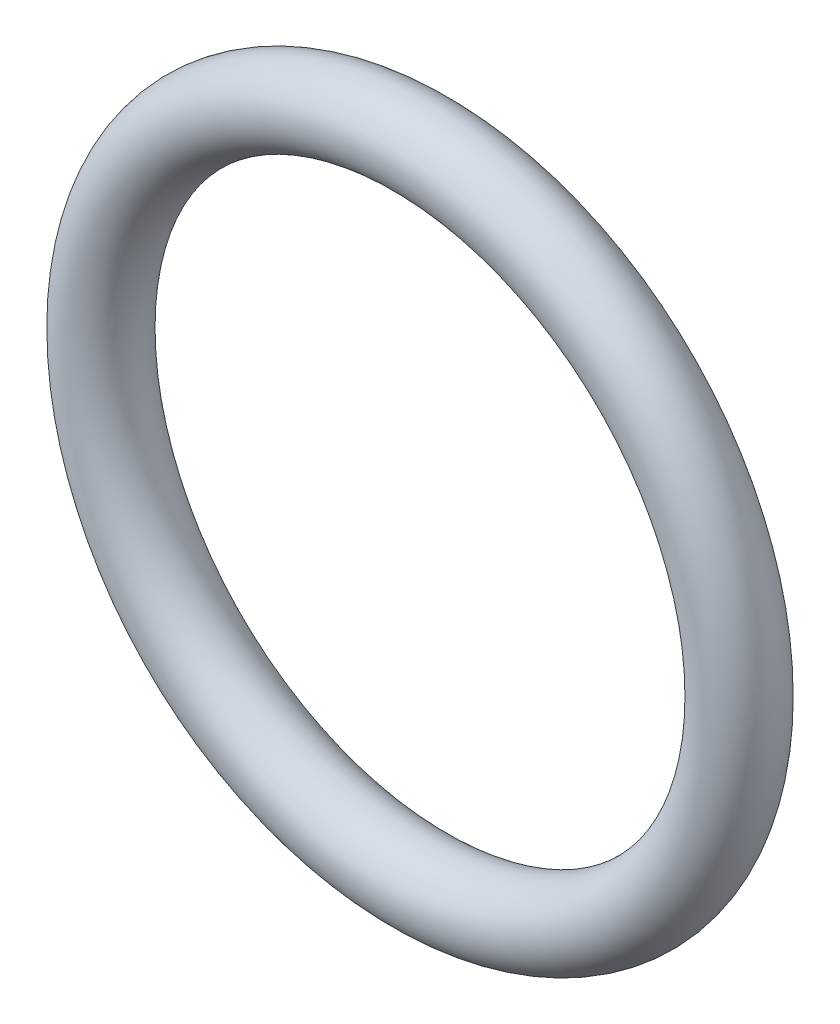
ISO-10303-21;
HEADER;
FILE_DESCRIPTION(('STEP AP214'),'2;1');
FILE_NAME('part.step','',(''),(''),'','','');
FILE_SCHEMA(('AUTOMOTIVE_DESIGN { 1 0 10303 214 1 1 1 1 }'));
ENDSEC;
DATA;
#1=APPLICATION_CONTEXT('core data for automotive mechanical design processes');
#2=APPLICATION_PROTOCOL_DEFINITION('international standard','automotive_design',2000,#1);
#3=PRODUCT_CONTEXT('',#1,'mechanical');
#4=PRODUCT('Part','Part','',(#3));
#5=PRODUCT_RELATED_PRODUCT_CATEGORY('part','',(#4));
#6=PRODUCT_DEFINITION_FORMATION('','',#4);
#7=PRODUCT_DEFINITION_CONTEXT('part definition',#1,'design');
#8=PRODUCT_DEFINITION('design','',#6,#7);
#9=PRODUCT_DEFINITION_SHAPE('','',#8);
#10=(LENGTH_UNIT() NAMED_UNIT(*) SI_UNIT(.MILLI.,.METRE.));
#11=(NAMED_UNIT(*) PLANE_ANGLE_UNIT() SI_UNIT($,.RADIAN.));
#12=(NAMED_UNIT(*) SI_UNIT($,.STERADIAN.) SOLID_ANGLE_UNIT());
#13=UNCERTAINTY_MEASURE_WITH_UNIT(LENGTH_MEASURE(1.E-05),#10,'distance_accuracy_value','');
#14=(GEOMETRIC_REPRESENTATION_CONTEXT(3) GLOBAL_UNCERTAINTY_ASSIGNED_CONTEXT((#13)) GLOBAL_UNIT_ASSIGNED_CONTEXT((#10,
#11,#12)) REPRESENTATION_CONTEXT('',''));
#15=CARTESIAN_POINT('',(0.,0.,0.));
#16=DIRECTION('',(0.,0.,1.));
#17=DIRECTION('',(1.,0.,0.));
#18=AXIS2_PLACEMENT_3D('',#15,#16,#17);
#19=CARTESIAN_POINT('',(0.,0.,0.));
#20=DIRECTION('',(0.,0.,1.));
#21=DIRECTION('',(1.,0.,0.));
#22=AXIS2_PLACEMENT_3D('',#19,#20,#21);
#23=TOROIDAL_SURFACE('',#22,12.5,1.5);
#24=CARTESIAN_POINT('',(12.5,0.,0.));
#25=DIRECTION('',(0.,1.,0.));
#26=DIRECTION('',(-1.,0.,0.));
#27=AXIS2_PLACEMENT_3D('',#24,#25,#26);
#28=CIRCLE('',#27,1.5);
#29=CARTESIAN_POINT('',(14.,0.,0.));
#30=VERTEX_POINT('',#29);
#31=EDGE_CURVE('E11',#30,#30,#28,.T.);
#32=CARTESIAN_POINT('',(0.,0.,0.));
#33=DIRECTION('',(0.,0.,1.));
#34=DIRECTION('',(1.,0.,0.));
#35=AXIS2_PLACEMENT_3D('',#32,#33,#34);
#36=CIRCLE('',#35,14.);
#37=EDGE_CURVE('',#30,#30,#36,.T.);
#38=ORIENTED_EDGE('',*,*,#31,.T.);
#39=ORIENTED_EDGE('',*,*,#31,.F.);
#40=ORIENTED_EDGE('',*,*,#37,.T.);
#41=ORIENTED_EDGE('',*,*,#37,.F.);
#42=EDGE_LOOP('',(#38,#40,#39,#41));
#43=FACE_BOUND('',#42,.T.);
#44=ADVANCED_FACE('F46',(#43),#23,.T.);
#45=CLOSED_SHELL('',(#44));
#46=MANIFOLD_SOLID_BREP('B2',#45);
#47=ADVANCED_BREP_SHAPE_REPRESENTATION('',(#18,#46),#14);
#48=SHAPE_DEFINITION_REPRESENTATION(#9,#47);
ENDSEC;
END-ISO-10303-21;
